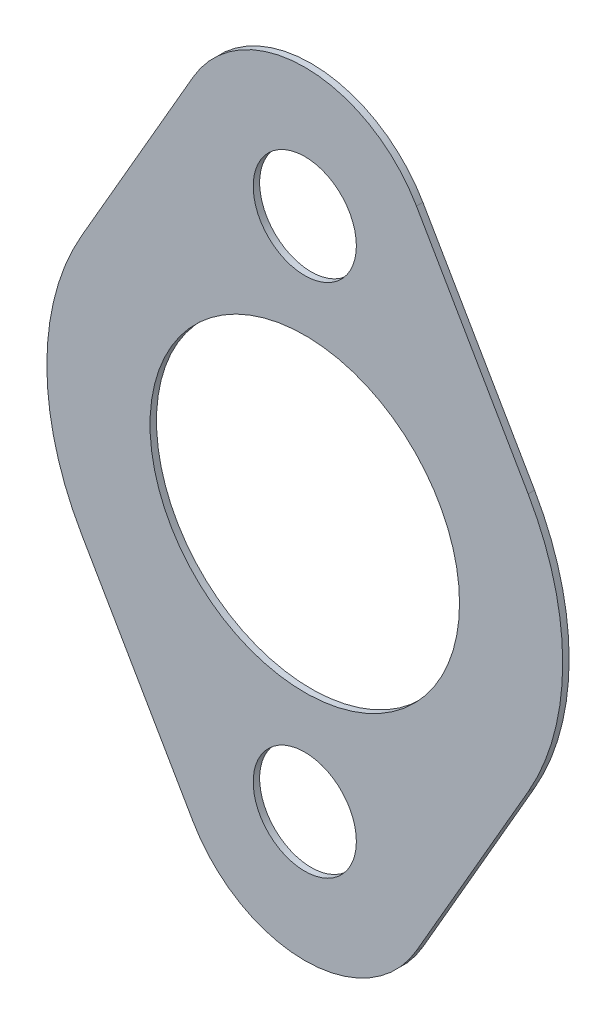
ISO-10303-21;
HEADER;
FILE_DESCRIPTION(('STEP AP214'),'2;1');
FILE_NAME('part.step','',(''),(''),'','','');
FILE_SCHEMA(('AUTOMOTIVE_DESIGN { 1 0 10303 214 1 1 1 1 }'));
ENDSEC;
DATA;
#1=APPLICATION_CONTEXT('core data for automotive mechanical design processes');
#2=APPLICATION_PROTOCOL_DEFINITION('international standard','automotive_design',2000,#1);
#3=PRODUCT_CONTEXT('',#1,'mechanical');
#4=PRODUCT('Part','Part','',(#3));
#5=PRODUCT_RELATED_PRODUCT_CATEGORY('part','',(#4));
#6=PRODUCT_DEFINITION_FORMATION('','',#4);
#7=PRODUCT_DEFINITION_CONTEXT('part definition',#1,'design');
#8=PRODUCT_DEFINITION('design','',#6,#7);
#9=PRODUCT_DEFINITION_SHAPE('','',#8);
#10=(LENGTH_UNIT() NAMED_UNIT(*) SI_UNIT(.MILLI.,.METRE.));
#11=(NAMED_UNIT(*) PLANE_ANGLE_UNIT() SI_UNIT($,.RADIAN.));
#12=(NAMED_UNIT(*) SI_UNIT($,.STERADIAN.) SOLID_ANGLE_UNIT());
#13=UNCERTAINTY_MEASURE_WITH_UNIT(LENGTH_MEASURE(1.E-05),#10,'distance_accuracy_value','');
#14=(GEOMETRIC_REPRESENTATION_CONTEXT(3) GLOBAL_UNCERTAINTY_ASSIGNED_CONTEXT((#13)) GLOBAL_UNIT_ASSIGNED_CONTEXT((#10,
#11,#12)) REPRESENTATION_CONTEXT('',''));
#15=CARTESIAN_POINT('',(0.,0.,0.));
#16=DIRECTION('',(0.,0.,1.));
#17=DIRECTION('',(1.,0.,0.));
#18=AXIS2_PLACEMENT_3D('',#15,#16,#17);
#19=CARTESIAN_POINT('',(0.,63.5,1.5875));
#20=DIRECTION('',(0.,0.,-1.));
#21=DIRECTION('',(-1.,0.,0.));
#22=AXIS2_PLACEMENT_3D('',#19,#20,#21);
#23=CYLINDRICAL_SURFACE('',#22,31.75);
#24=CARTESIAN_POINT('',(0.,63.5,0.));
#25=DIRECTION('',(0.,0.,-1.));
#26=DIRECTION('',(-1.,0.,0.));
#27=AXIS2_PLACEMENT_3D('',#24,#25,#26);
#28=CIRCLE('',#27,31.75);
#29=CARTESIAN_POINT('',(-27.4963065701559,79.375,0.));
#30=VERTEX_POINT('',#29);
#31=CARTESIAN_POINT('',(27.4963065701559,79.375,0.));
#32=VERTEX_POINT('',#31);
#33=EDGE_CURVE('E93',#30,#32,#28,.T.);
#34=ORIENTED_EDGE('',*,*,#33,.F.);
#35=DIRECTION('',(0.,0.,-1.));
#36=VECTOR('',#35,1.);
#37=CARTESIAN_POINT('',(-27.4963065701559,79.375,1.5875));
#38=LINE('',#37,#36);
#39=CARTESIAN_POINT('',(-27.4963065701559,79.375,1.5875));
#40=VERTEX_POINT('',#39);
#41=EDGE_CURVE('E11',#40,#30,#38,.T.);
#42=ORIENTED_EDGE('',*,*,#41,.F.);
#43=CARTESIAN_POINT('',(0.,63.5,1.5875));
#44=DIRECTION('',(0.,0.,-1.));
#45=DIRECTION('',(-1.,0.,0.));
#46=AXIS2_PLACEMENT_3D('',#43,#44,#45);
#47=CIRCLE('',#46,31.75);
#48=CARTESIAN_POINT('',(27.4963065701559,79.375,1.5875));
#49=VERTEX_POINT('',#48);
#50=EDGE_CURVE('E94',#40,#49,#47,.T.);
#51=ORIENTED_EDGE('',*,*,#50,.T.);
#52=DIRECTION('',(0.,0.,-1.));
#53=VECTOR('',#52,1.);
#54=CARTESIAN_POINT('',(27.4963065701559,79.375,1.5875));
#55=LINE('',#54,#53);
#56=EDGE_CURVE('E31',#49,#32,#55,.T.);
#57=ORIENTED_EDGE('',*,*,#56,.T.);
#58=EDGE_LOOP('',(#34,#42,#51,#57));
#59=FACE_BOUND('',#58,.T.);
#60=ADVANCED_FACE('F28',(#59),#23,.T.);
#61=CARTESIAN_POINT('',(-27.4963065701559,79.375,1.5875));
#62=DIRECTION('',(0.866025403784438,-0.5,0.));
#63=DIRECTION('',(0.5,0.866025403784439,0.));
#64=AXIS2_PLACEMENT_3D('',#61,#62,#63);
#65=PLANE('',#64);
#66=DIRECTION('',(-0.5,-0.866025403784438,0.));
#67=VECTOR('',#66,1.);
#68=CARTESIAN_POINT('',(-27.4963065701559,79.375,0.));
#69=LINE('',#68,#67);
#70=CARTESIAN_POINT('',(-54.9926131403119,31.75,0.));
#71=VERTEX_POINT('',#70);
#72=EDGE_CURVE('E111',#30,#71,#69,.T.);
#73=ORIENTED_EDGE('',*,*,#72,.T.);
#74=DIRECTION('',(0.,0.,-1.));
#75=VECTOR('',#74,1.);
#76=CARTESIAN_POINT('',(-54.9926131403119,31.75,1.5875));
#77=LINE('',#76,#75);
#78=CARTESIAN_POINT('',(-54.9926131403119,31.75,1.5875));
#79=VERTEX_POINT('',#78);
#80=EDGE_CURVE('E36',#79,#71,#77,.T.);
#81=ORIENTED_EDGE('',*,*,#80,.F.);
#82=DIRECTION('',(-0.5,-0.866025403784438,0.));
#83=VECTOR('',#82,1.);
#84=CARTESIAN_POINT('',(-27.4963065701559,79.375,1.5875));
#85=LINE('',#84,#83);
#86=EDGE_CURVE('E49',#40,#79,#85,.T.);
#87=ORIENTED_EDGE('',*,*,#86,.F.);
#88=ORIENTED_EDGE('',*,*,#41,.T.);
#89=EDGE_LOOP('',(#73,#81,#87,#88));
#90=FACE_BOUND('',#89,.T.);
#91=ADVANCED_FACE('F177',(#90),#65,.F.);
#92=CARTESIAN_POINT('',(0.,0.,1.5875));
#93=DIRECTION('',(0.,0.,-1.));
#94=DIRECTION('',(-1.,0.,0.));
#95=AXIS2_PLACEMENT_3D('',#92,#93,#94);
#96=CYLINDRICAL_SURFACE('',#95,63.5);
#97=CARTESIAN_POINT('',(0.,0.,0.));
#98=DIRECTION('',(0.,0.,-1.));
#99=DIRECTION('',(-1.,0.,0.));
#100=AXIS2_PLACEMENT_3D('',#97,#98,#99);
#101=CIRCLE('',#100,63.5);
#102=CARTESIAN_POINT('',(-54.9926131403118,-31.75,0.));
#103=VERTEX_POINT('',#102);
#104=EDGE_CURVE('E128',#103,#71,#101,.T.);
#105=ORIENTED_EDGE('',*,*,#104,.F.);
#106=DIRECTION('',(0.,0.,-1.));
#107=VECTOR('',#106,1.);
#108=CARTESIAN_POINT('',(-54.9926131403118,-31.75,1.5875));
#109=LINE('',#108,#107);
#110=CARTESIAN_POINT('',(-54.9926131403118,-31.75,1.5875));
#111=VERTEX_POINT('',#110);
#112=EDGE_CURVE('E149',#111,#103,#109,.T.);
#113=ORIENTED_EDGE('',*,*,#112,.F.);
#114=CARTESIAN_POINT('',(0.,0.,1.5875));
#115=DIRECTION('',(0.,0.,-1.));
#116=DIRECTION('',(-1.,0.,0.));
#117=AXIS2_PLACEMENT_3D('',#114,#115,#116);
#118=CIRCLE('',#117,63.5);
#119=EDGE_CURVE('E144',#111,#79,#118,.T.);
#120=ORIENTED_EDGE('',*,*,#119,.T.);
#121=ORIENTED_EDGE('',*,*,#80,.T.);
#122=EDGE_LOOP('',(#105,#113,#120,#121));
#123=FACE_BOUND('',#122,.T.);
#124=ADVANCED_FACE('F175',(#123),#96,.T.);
#125=CARTESIAN_POINT('',(-27.4963065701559,-79.375,1.5875));
#126=DIRECTION('',(-0.866025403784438,-0.5,0.));
#127=DIRECTION('',(0.5,-0.866025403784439,0.));
#128=AXIS2_PLACEMENT_3D('',#125,#126,#127);
#129=PLANE('',#128);
#130=DIRECTION('',(-0.5,0.866025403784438,0.));
#131=VECTOR('',#130,1.);
#132=CARTESIAN_POINT('',(-27.4963065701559,-79.375,0.));
#133=LINE('',#132,#131);
#134=CARTESIAN_POINT('',(-27.4963065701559,-79.375,0.));
#135=VERTEX_POINT('',#134);
#136=EDGE_CURVE('E125',#135,#103,#133,.T.);
#137=ORIENTED_EDGE('',*,*,#136,.F.);
#138=DIRECTION('',(0.,0.,-1.));
#139=VECTOR('',#138,1.);
#140=CARTESIAN_POINT('',(-27.4963065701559,-79.375,1.5875));
#141=LINE('',#140,#139);
#142=CARTESIAN_POINT('',(-27.4963065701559,-79.375,1.5875));
#143=VERTEX_POINT('',#142);
#144=EDGE_CURVE('E151',#143,#135,#141,.T.);
#145=ORIENTED_EDGE('',*,*,#144,.F.);
#146=DIRECTION('',(-0.5,0.866025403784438,0.));
#147=VECTOR('',#146,1.);
#148=CARTESIAN_POINT('',(-27.4963065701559,-79.375,1.5875));
#149=LINE('',#148,#147);
#150=EDGE_CURVE('E141',#143,#111,#149,.T.);
#151=ORIENTED_EDGE('',*,*,#150,.T.);
#152=ORIENTED_EDGE('',*,*,#112,.T.);
#153=EDGE_LOOP('',(#137,#145,#151,#152));
#154=FACE_BOUND('',#153,.T.);
#155=ADVANCED_FACE('F170',(#154),#129,.T.);
#156=CARTESIAN_POINT('',(0.,-63.5,1.5875));
#157=DIRECTION('',(0.,0.,-1.));
#158=DIRECTION('',(-1.,0.,0.));
#159=AXIS2_PLACEMENT_3D('',#156,#157,#158);
#160=CYLINDRICAL_SURFACE('',#159,31.75);
#161=CARTESIAN_POINT('',(0.,-63.5,0.));
#162=DIRECTION('',(0.,0.,1.));
#163=DIRECTION('',(1.,0.,0.));
#164=AXIS2_PLACEMENT_3D('',#161,#162,#163);
#165=CIRCLE('',#164,31.75);
#166=CARTESIAN_POINT('',(27.4963065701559,-79.375,0.));
#167=VERTEX_POINT('',#166);
#168=EDGE_CURVE('E123',#135,#167,#165,.T.);
#169=ORIENTED_EDGE('',*,*,#168,.T.);
#170=DIRECTION('',(0.,0.,-1.));
#171=VECTOR('',#170,1.);
#172=CARTESIAN_POINT('',(27.4963065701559,-79.375,1.5875));
#173=LINE('',#172,#171);
#174=CARTESIAN_POINT('',(27.4963065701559,-79.375,1.5875));
#175=VERTEX_POINT('',#174);
#176=EDGE_CURVE('E153',#175,#167,#173,.T.);
#177=ORIENTED_EDGE('',*,*,#176,.F.);
#178=CARTESIAN_POINT('',(0.,-63.5,1.5875));
#179=DIRECTION('',(0.,0.,1.));
#180=DIRECTION('',(1.,0.,0.));
#181=AXIS2_PLACEMENT_3D('',#178,#179,#180);
#182=CIRCLE('',#181,31.75);
#183=EDGE_CURVE('E139',#143,#175,#182,.T.);
#184=ORIENTED_EDGE('',*,*,#183,.F.);
#185=ORIENTED_EDGE('',*,*,#144,.T.);
#186=EDGE_LOOP('',(#169,#177,#184,#185));
#187=FACE_BOUND('',#186,.T.);
#188=ADVANCED_FACE('F179',(#187),#160,.T.);
#189=CARTESIAN_POINT('',(27.4963065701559,-79.375,1.5875));
#190=DIRECTION('',(-0.866025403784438,0.5,0.));
#191=DIRECTION('',(-0.5,-0.866025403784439,0.));
#192=AXIS2_PLACEMENT_3D('',#189,#190,#191);
#193=PLANE('',#192);
#194=DIRECTION('',(0.5,0.866025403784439,0.));
#195=VECTOR('',#194,1.);
#196=CARTESIAN_POINT('',(27.4963065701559,-79.375,0.));
#197=LINE('',#196,#195);
#198=CARTESIAN_POINT('',(54.9926131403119,-31.75,0.));
#199=VERTEX_POINT('',#198);
#200=EDGE_CURVE('E120',#167,#199,#197,.T.);
#201=ORIENTED_EDGE('',*,*,#200,.T.);
#202=DIRECTION('',(0.,0.,-1.));
#203=VECTOR('',#202,1.);
#204=CARTESIAN_POINT('',(54.9926131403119,-31.75,1.5875));
#205=LINE('',#204,#203);
#206=CARTESIAN_POINT('',(54.9926131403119,-31.75,1.5875));
#207=VERTEX_POINT('',#206);
#208=EDGE_CURVE('E156',#207,#199,#205,.T.);
#209=ORIENTED_EDGE('',*,*,#208,.F.);
#210=DIRECTION('',(0.5,0.866025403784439,0.));
#211=VECTOR('',#210,1.);
#212=CARTESIAN_POINT('',(27.4963065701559,-79.375,1.5875));
#213=LINE('',#212,#211);
#214=EDGE_CURVE('E137',#175,#207,#213,.T.);
#215=ORIENTED_EDGE('',*,*,#214,.F.);
#216=ORIENTED_EDGE('',*,*,#176,.T.);
#217=EDGE_LOOP('',(#201,#209,#215,#216));
#218=FACE_BOUND('',#217,.T.);
#219=ADVANCED_FACE('F164',(#218),#193,.F.);
#220=CARTESIAN_POINT('',(0.,0.,1.5875));
#221=DIRECTION('',(0.,0.,-1.));
#222=DIRECTION('',(-1.,0.,0.));
#223=AXIS2_PLACEMENT_3D('',#220,#221,#222);
#224=CYLINDRICAL_SURFACE('',#223,63.5);
#225=CARTESIAN_POINT('',(0.,0.,0.));
#226=DIRECTION('',(0.,0.,-1.));
#227=DIRECTION('',(-1.,0.,0.));
#228=AXIS2_PLACEMENT_3D('',#225,#226,#227);
#229=CIRCLE('',#228,63.5);
#230=CARTESIAN_POINT('',(54.9926131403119,31.75,0.));
#231=VERTEX_POINT('',#230);
#232=EDGE_CURVE('E105',#231,#199,#229,.T.);
#233=ORIENTED_EDGE('',*,*,#232,.F.);
#234=DIRECTION('',(0.,0.,-1.));
#235=VECTOR('',#234,1.);
#236=CARTESIAN_POINT('',(54.9926131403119,31.75,1.5875));
#237=LINE('',#236,#235);
#238=CARTESIAN_POINT('',(54.9926131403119,31.75,1.5875));
#239=VERTEX_POINT('',#238);
#240=EDGE_CURVE('E98',#239,#231,#237,.T.);
#241=ORIENTED_EDGE('',*,*,#240,.F.);
#242=CARTESIAN_POINT('',(0.,0.,1.5875));
#243=DIRECTION('',(0.,0.,-1.));
#244=DIRECTION('',(-1.,0.,0.));
#245=AXIS2_PLACEMENT_3D('',#242,#243,#244);
#246=CIRCLE('',#245,63.5);
#247=EDGE_CURVE('E134',#239,#207,#246,.T.);
#248=ORIENTED_EDGE('',*,*,#247,.T.);
#249=ORIENTED_EDGE('',*,*,#208,.T.);
#250=EDGE_LOOP('',(#233,#241,#248,#249));
#251=FACE_BOUND('',#250,.T.);
#252=ADVANCED_FACE('F159',(#251),#224,.T.);
#253=CARTESIAN_POINT('',(27.4963065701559,79.375,1.5875));
#254=DIRECTION('',(0.866025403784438,0.5,0.));
#255=DIRECTION('',(-0.5,0.866025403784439,0.));
#256=AXIS2_PLACEMENT_3D('',#253,#254,#255);
#257=PLANE('',#256);
#258=DIRECTION('',(0.5,-0.866025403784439,0.));
#259=VECTOR('',#258,1.);
#260=CARTESIAN_POINT('',(27.4963065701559,79.375,0.));
#261=LINE('',#260,#259);
#262=EDGE_CURVE('E100',#32,#231,#261,.T.);
#263=ORIENTED_EDGE('',*,*,#262,.F.);
#264=ORIENTED_EDGE('',*,*,#56,.F.);
#265=DIRECTION('',(0.5,-0.866025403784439,0.));
#266=VECTOR('',#265,1.);
#267=CARTESIAN_POINT('',(27.4963065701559,79.375,1.5875));
#268=LINE('',#267,#266);
#269=EDGE_CURVE('E132',#49,#239,#268,.T.);
#270=ORIENTED_EDGE('',*,*,#269,.T.);
#271=ORIENTED_EDGE('',*,*,#240,.T.);
#272=EDGE_LOOP('',(#263,#264,#270,#271));
#273=FACE_BOUND('',#272,.T.);
#274=ADVANCED_FACE('F101',(#273),#257,.T.);
#275=CARTESIAN_POINT('',(0.,63.5,1.5875));
#276=DIRECTION('',(0.,0.,-1.));
#277=DIRECTION('',(-1.,0.,0.));
#278=AXIS2_PLACEMENT_3D('',#275,#276,#277);
#279=PLANE('',#278);
#280=CARTESIAN_POINT('',(0.,0.,1.5875));
#281=DIRECTION('',(0.,0.,1.));
#282=DIRECTION('',(1.,0.,0.));
#283=AXIS2_PLACEMENT_3D('',#280,#281,#282);
#284=CIRCLE('',#283,38.1);
#285=CARTESIAN_POINT('',(38.1,0.,1.5875));
#286=VERTEX_POINT('',#285);
#287=EDGE_CURVE('E223',#286,#286,#284,.T.);
#288=ORIENTED_EDGE('',*,*,#287,.F.);
#289=EDGE_LOOP('',(#288));
#290=FACE_BOUND('',#289,.T.);
#291=CARTESIAN_POINT('',(0.,-63.5,1.5875));
#292=DIRECTION('',(0.,0.,1.));
#293=DIRECTION('',(1.,0.,0.));
#294=AXIS2_PLACEMENT_3D('',#291,#292,#293);
#295=CIRCLE('',#294,12.7);
#296=CARTESIAN_POINT('',(12.7,-63.5,1.5875));
#297=VERTEX_POINT('',#296);
#298=EDGE_CURVE('E225',#297,#297,#295,.T.);
#299=ORIENTED_EDGE('',*,*,#298,.F.);
#300=EDGE_LOOP('',(#299));
#301=FACE_BOUND('',#300,.T.);
#302=CARTESIAN_POINT('',(0.,63.5,1.5875));
#303=DIRECTION('',(0.,0.,1.));
#304=DIRECTION('',(1.,0.,0.));
#305=AXIS2_PLACEMENT_3D('',#302,#303,#304);
#306=CIRCLE('',#305,12.7);
#307=CARTESIAN_POINT('',(12.7,63.5,1.5875));
#308=VERTEX_POINT('',#307);
#309=EDGE_CURVE('E115',#308,#308,#306,.T.);
#310=ORIENTED_EDGE('',*,*,#309,.F.);
#311=EDGE_LOOP('',(#310));
#312=FACE_BOUND('',#311,.T.);
#313=ORIENTED_EDGE('',*,*,#50,.F.);
#314=ORIENTED_EDGE('',*,*,#86,.T.);
#315=ORIENTED_EDGE('',*,*,#119,.F.);
#316=ORIENTED_EDGE('',*,*,#150,.F.);
#317=ORIENTED_EDGE('',*,*,#183,.T.);
#318=ORIENTED_EDGE('',*,*,#214,.T.);
#319=ORIENTED_EDGE('',*,*,#247,.F.);
#320=ORIENTED_EDGE('',*,*,#269,.F.);
#321=EDGE_LOOP('',(#313,#314,#315,#316,#317,#318,#319,#320));
#322=FACE_BOUND('',#321,.T.);
#323=ADVANCED_FACE('F178',(#290,#301,#312,#322),#279,.F.);
#324=CARTESIAN_POINT('',(0.,63.5,0.));
#325=DIRECTION('',(0.,0.,-1.));
#326=DIRECTION('',(-1.,0.,0.));
#327=AXIS2_PLACEMENT_3D('',#324,#325,#326);
#328=PLANE('',#327);
#329=CARTESIAN_POINT('',(0.,0.,0.));
#330=DIRECTION('',(0.,0.,1.));
#331=DIRECTION('',(1.,0.,0.));
#332=AXIS2_PLACEMENT_3D('',#329,#330,#331);
#333=CIRCLE('',#332,38.1);
#334=CARTESIAN_POINT('',(38.1,0.,0.));
#335=VERTEX_POINT('',#334);
#336=EDGE_CURVE('E220',#335,#335,#333,.T.);
#337=ORIENTED_EDGE('',*,*,#336,.T.);
#338=EDGE_LOOP('',(#337));
#339=FACE_BOUND('',#338,.T.);
#340=CARTESIAN_POINT('',(0.,-63.5,0.));
#341=DIRECTION('',(0.,0.,1.));
#342=DIRECTION('',(1.,0.,0.));
#343=AXIS2_PLACEMENT_3D('',#340,#341,#342);
#344=CIRCLE('',#343,12.7);
#345=CARTESIAN_POINT('',(12.7,-63.5,0.));
#346=VERTEX_POINT('',#345);
#347=EDGE_CURVE('E230',#346,#346,#344,.T.);
#348=ORIENTED_EDGE('',*,*,#347,.T.);
#349=EDGE_LOOP('',(#348));
#350=FACE_BOUND('',#349,.T.);
#351=CARTESIAN_POINT('',(0.,63.5,0.));
#352=DIRECTION('',(0.,0.,1.));
#353=DIRECTION('',(1.,0.,0.));
#354=AXIS2_PLACEMENT_3D('',#351,#352,#353);
#355=CIRCLE('',#354,12.7);
#356=CARTESIAN_POINT('',(12.7,63.5,0.));
#357=VERTEX_POINT('',#356);
#358=EDGE_CURVE('E112',#357,#357,#355,.T.);
#359=ORIENTED_EDGE('',*,*,#358,.T.);
#360=EDGE_LOOP('',(#359));
#361=FACE_BOUND('',#360,.T.);
#362=ORIENTED_EDGE('',*,*,#33,.T.);
#363=ORIENTED_EDGE('',*,*,#262,.T.);
#364=ORIENTED_EDGE('',*,*,#232,.T.);
#365=ORIENTED_EDGE('',*,*,#200,.F.);
#366=ORIENTED_EDGE('',*,*,#168,.F.);
#367=ORIENTED_EDGE('',*,*,#136,.T.);
#368=ORIENTED_EDGE('',*,*,#104,.T.);
#369=ORIENTED_EDGE('',*,*,#72,.F.);
#370=EDGE_LOOP('',(#362,#363,#364,#365,#366,#367,#368,#369));
#371=FACE_BOUND('',#370,.T.);
#372=ADVANCED_FACE('F108',(#339,#350,#361,#371),#328,.T.);
#373=CARTESIAN_POINT('',(0.,63.5,0.));
#374=DIRECTION('',(0.,0.,1.));
#375=DIRECTION('',(1.,0.,0.));
#376=AXIS2_PLACEMENT_3D('',#373,#374,#375);
#377=CYLINDRICAL_SURFACE('',#376,12.7);
#378=ORIENTED_EDGE('',*,*,#358,.F.);
#379=EDGE_LOOP('',(#378));
#380=FACE_BOUND('',#379,.T.);
#381=ORIENTED_EDGE('',*,*,#309,.T.);
#382=EDGE_LOOP('',(#381));
#383=FACE_BOUND('',#382,.T.);
#384=ADVANCED_FACE('F203',(#380,#383),#377,.F.);
#385=CARTESIAN_POINT('',(0.,-63.5,0.));
#386=DIRECTION('',(0.,0.,1.));
#387=DIRECTION('',(1.,0.,0.));
#388=AXIS2_PLACEMENT_3D('',#385,#386,#387);
#389=CYLINDRICAL_SURFACE('',#388,12.7);
#390=ORIENTED_EDGE('',*,*,#347,.F.);
#391=EDGE_LOOP('',(#390));
#392=FACE_BOUND('',#391,.T.);
#393=ORIENTED_EDGE('',*,*,#298,.T.);
#394=EDGE_LOOP('',(#393));
#395=FACE_BOUND('',#394,.T.);
#396=ADVANCED_FACE('F207',(#392,#395),#389,.F.);
#397=CARTESIAN_POINT('',(0.,0.,0.));
#398=DIRECTION('',(0.,0.,1.));
#399=DIRECTION('',(1.,0.,0.));
#400=AXIS2_PLACEMENT_3D('',#397,#398,#399);
#401=CYLINDRICAL_SURFACE('',#400,38.1);
#402=ORIENTED_EDGE('',*,*,#336,.F.);
#403=EDGE_LOOP('',(#402));
#404=FACE_BOUND('',#403,.T.);
#405=ORIENTED_EDGE('',*,*,#287,.T.);
#406=EDGE_LOOP('',(#405));
#407=FACE_BOUND('',#406,.T.);
#408=ADVANCED_FACE('F211',(#404,#407),#401,.F.);
#409=CLOSED_SHELL('',(#60,#91,#124,#155,#188,#219,#252,#274,#323,#372,#384,#396,#408));
#410=MANIFOLD_SOLID_BREP('B2',#409);
#411=ADVANCED_BREP_SHAPE_REPRESENTATION('',(#18,#410),#14);
#412=SHAPE_DEFINITION_REPRESENTATION(#9,#411);
ENDSEC;
END-ISO-10303-21;
